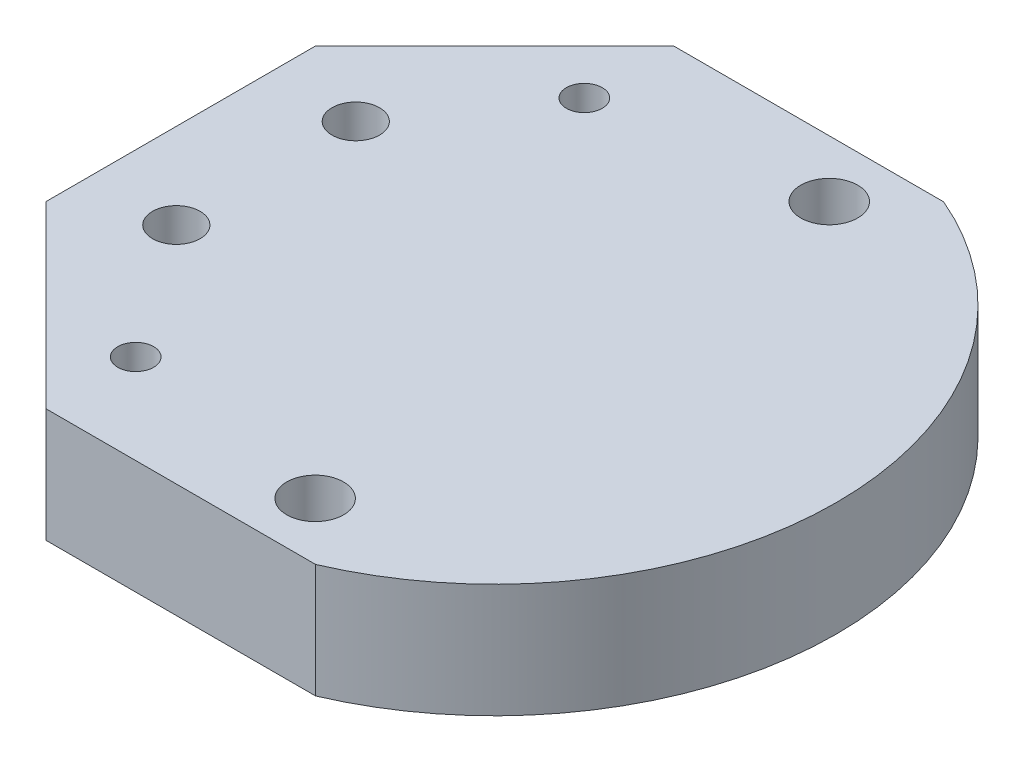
from build123d import *

# Parameters (mm, degrees)
SKETCH1_R                      = 38.1
BOSS_EXTRUDE2_DEPTH            = 12.7
SKETCH4_OUTSIDE_W              = 99.902
SKETCH4_OUTSIDE_H              = 99.902
CUT_EXTRUDE1_DEPTH             = 12.7
F_1_4_0_25_DIAMETER_HOLE1_D    = 6.35
CBORE_FOR_M5_SHCS1_D           = 5.3
CBORE_FOR_M5_SHCS1_CBORE_D     = 10
CBORE_FOR_M5_SHCS1_CBORE_DEPTH = 6
SKETCH9_R                      = 2
CUT_EXTRUDE2_DEPTH             = 54.271943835


with BuildPart() as part:
    # Sketch1 → Boss-Extrude2 (new body)
    with BuildSketch(Plane(origin=(0, 0, 0), x_dir=(1, 0, 0), z_dir=(0, 1, 0))):
        with Locations(Location((0, 0, 0), (0, 0, 270))):
            Circle(SKETCH1_R)
    extrude(amount=BOSS_EXTRUDE2_DEPTH)

    # Sketch4 outside → Cut-Extrude1 (cut)
    with BuildSketch(Plane(origin=(0, 12.7, 0), x_dir=(1, 0, 0), z_dir=(0, 1, 0))):
        Rectangle(SKETCH4_OUTSIDE_W, SKETCH4_OUTSIDE_H)
        Polygon((-15, 35), (-35, 15), (-35, -15), (-15, -35), (40, -35), (40, 35), align=None, mode=Mode.SUBTRACT)
    extrude(amount=-CUT_EXTRUDE1_DEPTH, mode=Mode.SUBTRACT)

    # 1_4 _0.25_ Diameter Hole1 (through all)
    with Locations(Plane(origin=(0, 12.7, 0), x_dir=(-1, 0, 0), z_dir=(0, 1, 0))):
        with Locations((-8.65, -28.65), (-8.65, 28.65)):
            Hole(F_1_4_0_25_DIAMETER_HOLE1_D / 2)

    # CBORE for M5 SHCS1 (through all)
    with Locations(Plane.XZ):
        with Locations((-25.475, 10), (-25.475, -10)):
            CounterBoreHole(CBORE_FOR_M5_SHCS1_D / 2, CBORE_FOR_M5_SHCS1_CBORE_D / 2, CBORE_FOR_M5_SHCS1_CBORE_DEPTH)

    # Sketch9 → Cut-Extrude2 (cut, through all)
    with BuildSketch(Plane.XZ):
        with Locations(Location((-15, 25, 0), (0, 0, 270))):
            Circle(SKETCH9_R)
        with Locations(Location((-15, -25, 0), (0, 0, 270))):
            Circle(SKETCH9_R)
    extrude(amount=-CUT_EXTRUDE2_DEPTH, mode=Mode.SUBTRACT)


solid = part.part
